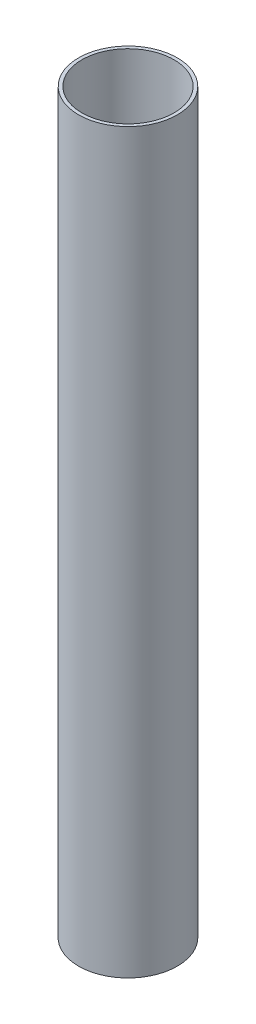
from build123d import *

# Parameters (mm, degrees)
SKETCH1_R           = 47.625
SKETCH1_R_2         = 44.45
BOSS_EXTRUDE1_DEPTH = 711.2


with BuildPart() as part:
    # Sketch1 → Boss-Extrude1 (new body)
    with BuildSketch(Plane(origin=(0, 0, 0), x_dir=(1, 0, 0), z_dir=(0, 1, 0))):
        with Locations(Location((0, 0, 0), (0, 0, 270))):
            Circle(SKETCH1_R)
        with Locations(Location((0, 0, 0), (0, 0, 270))):
            Circle(SKETCH1_R_2, mode=Mode.SUBTRACT)
    extrude(amount=BOSS_EXTRUDE1_DEPTH)


solid = part.part
